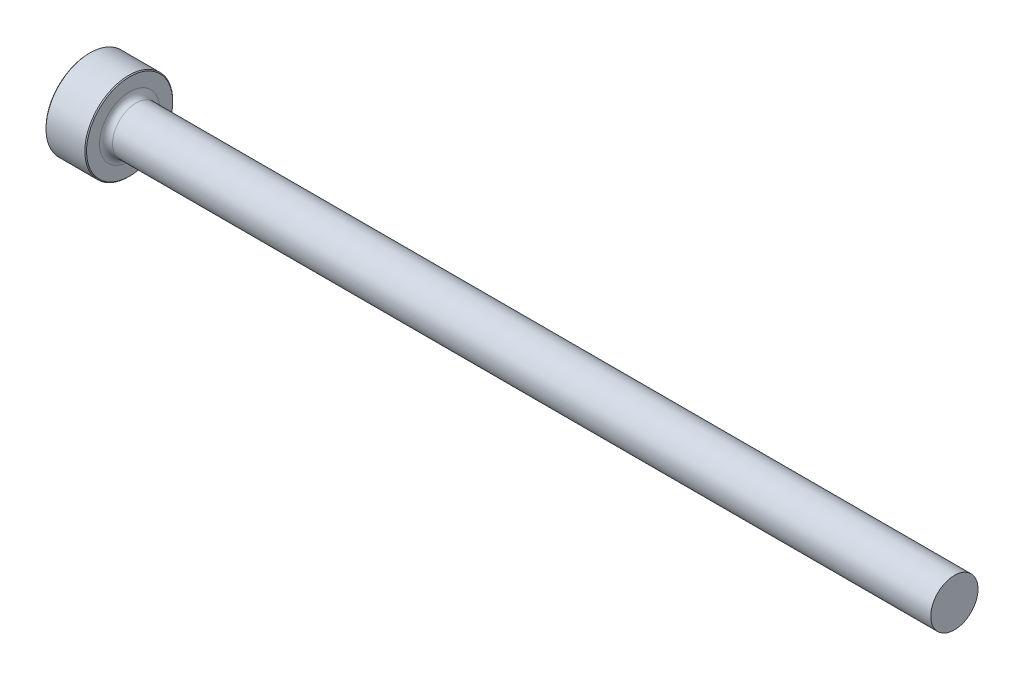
from build123d import *

# Parameters (mm, degrees)
CHAMFER1_SIZE = 0.1016


with BuildPart() as part:
    # Sketch1 → Revolve1 (revolve)
    with BuildSketch(Plane.XY):
        with BuildLine():
            Line((0, 0), (0, 5.159375))
            Line((0, 5.159375), (4.7625, 5.159375))
            Line((4.7625, 5.159375), (4.7625, 3.536315))
            ThreePointArc((4.7625, 3.536315), (4.985684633, 2.997499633), (5.5245, 2.774315))
            Line((5.5245, 2.774315), (101.6, 2.774315))
            Line((101.6, 2.774315), (101.6, 0))
            Line((101.6, 0), (0, 0))
        make_face()
    revolve(axis=Axis((101.6, 0, 0), (-1, 0, 0)))

    # Chamfer1
    chamfer1_edges = [part.edges().sort_by_distance(p)[0] for p in [
        (0, -5.159375, 0),
        (4.7625, -5.159375, 0),
    ]]
    chamfer(chamfer1_edges, length=CHAMFER1_SIZE)


solid = part.part
